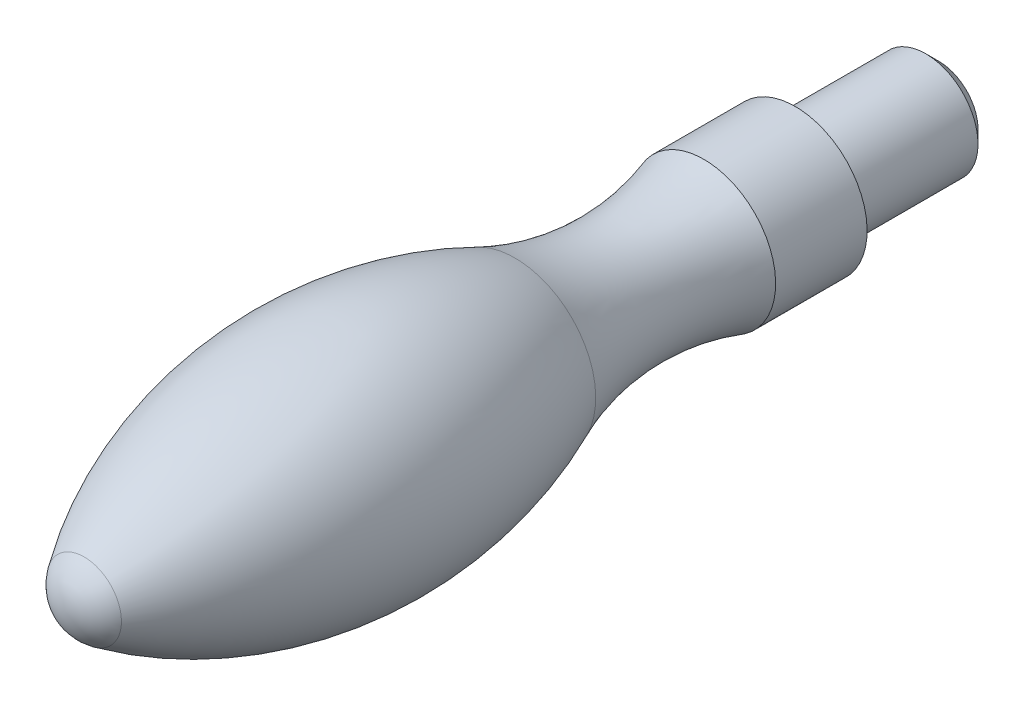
ISO-10303-21;
HEADER;
FILE_DESCRIPTION(('STEP AP214'),'2;1');
FILE_NAME('part.step','',(''),(''),'','','');
FILE_SCHEMA(('AUTOMOTIVE_DESIGN { 1 0 10303 214 1 1 1 1 }'));
ENDSEC;
DATA;
#1=APPLICATION_CONTEXT('core data for automotive mechanical design processes');
#2=APPLICATION_PROTOCOL_DEFINITION('international standard','automotive_design',2000,#1);
#3=PRODUCT_CONTEXT('',#1,'mechanical');
#4=PRODUCT('Part','Part','',(#3));
#5=PRODUCT_RELATED_PRODUCT_CATEGORY('part','',(#4));
#6=PRODUCT_DEFINITION_FORMATION('','',#4);
#7=PRODUCT_DEFINITION_CONTEXT('part definition',#1,'design');
#8=PRODUCT_DEFINITION('design','',#6,#7);
#9=PRODUCT_DEFINITION_SHAPE('','',#8);
#10=(LENGTH_UNIT() NAMED_UNIT(*) SI_UNIT(.MILLI.,.METRE.));
#11=(NAMED_UNIT(*) PLANE_ANGLE_UNIT() SI_UNIT($,.RADIAN.));
#12=(NAMED_UNIT(*) SI_UNIT($,.STERADIAN.) SOLID_ANGLE_UNIT());
#13=UNCERTAINTY_MEASURE_WITH_UNIT(LENGTH_MEASURE(1.E-05),#10,'distance_accuracy_value','');
#14=(GEOMETRIC_REPRESENTATION_CONTEXT(3) GLOBAL_UNCERTAINTY_ASSIGNED_CONTEXT((#13)) GLOBAL_UNIT_ASSIGNED_CONTEXT((#10,
#11,#12)) REPRESENTATION_CONTEXT('',''));
#15=CARTESIAN_POINT('',(0.,0.,0.));
#16=DIRECTION('',(0.,0.,1.));
#17=DIRECTION('',(1.,0.,0.));
#18=AXIS2_PLACEMENT_3D('',#15,#16,#17);
#19=CARTESIAN_POINT('',(0.,-1.94289029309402E-13,-26.9593603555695));
#20=DIRECTION('',(0.,0.,-1.));
#21=DIRECTION('',(0.,-1.,0.));
#22=AXIS2_PLACEMENT_3D('',#19,#20,#21);
#23=CYLINDRICAL_SURFACE('',#22,8.);
#24=CARTESIAN_POINT('',(0.,-1.92223031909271E-13,-20.));
#25=DIRECTION('',(0.,0.,-1.));
#26=DIRECTION('',(0.,1.,0.));
#27=AXIS2_PLACEMENT_3D('',#24,#25,#26);
#28=CIRCLE('',#27,8.);
#29=CARTESIAN_POINT('',(0.,7.99999999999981,-20.));
#30=VERTEX_POINT('',#29);
#31=EDGE_CURVE('E8',#30,#30,#28,.F.);
#32=ORIENTED_EDGE('',*,*,#31,.T.);
#33=EDGE_LOOP('',(#32));
#34=FACE_BOUND('',#33,.T.);
#35=CARTESIAN_POINT('',(0.,0.,0.));
#36=DIRECTION('',(0.,0.,-1.));
#37=DIRECTION('',(0.,-1.,0.));
#38=AXIS2_PLACEMENT_3D('',#35,#36,#37);
#39=CIRCLE('',#38,8.);
#40=CARTESIAN_POINT('',(0.,-8.,0.));
#41=VERTEX_POINT('',#40);
#42=EDGE_CURVE('E38',#41,#41,#39,.T.);
#43=ORIENTED_EDGE('',*,*,#42,.T.);
#44=EDGE_LOOP('',(#43));
#45=FACE_BOUND('',#44,.T.);
#46=ADVANCED_FACE('F12',(#34,#45),#23,.T.);
#47=CARTESIAN_POINT('',(0.,-2.22044604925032E-13,-22.));
#48=DIRECTION('',(0.,0.,-1.));
#49=DIRECTION('',(0.,-1.,0.));
#50=AXIS2_PLACEMENT_3D('',#47,#48,#49);
#51=PLANE('',#50);
#52=CARTESIAN_POINT('',(0.,-1.92816763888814E-13,-22.));
#53=DIRECTION('',(0.,0.,-1.));
#54=DIRECTION('',(0.,1.,0.));
#55=AXIS2_PLACEMENT_3D('',#52,#53,#54);
#56=CIRCLE('',#55,6.);
#57=CARTESIAN_POINT('',(0.,5.99999999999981,-22.));
#58=VERTEX_POINT('',#57);
#59=EDGE_CURVE('E19',#58,#58,#56,.T.);
#60=ORIENTED_EDGE('',*,*,#59,.T.);
#61=EDGE_LOOP('',(#60));
#62=FACE_BOUND('',#61,.T.);
#63=ADVANCED_FACE('F59',(#62),#51,.T.);
#64=CARTESIAN_POINT('',(0.,0.,105.021841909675));
#65=DIRECTION('',(-1.,0.,0.));
#66=DIRECTION('',(0.,3.23786493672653E-06,0.999999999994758));
#67=AXIS2_PLACEMENT_3D('',#64,#65,#66);
#68=SPHERICAL_SURFACE('',#67,6.97815809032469);
#69=CARTESIAN_POINT('',(0.,0.,105.021841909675));
#70=DIRECTION('',(0.,0.,-1.));
#71=DIRECTION('',(0.,-1.,0.));
#72=AXIS2_PLACEMENT_3D('',#69,#70,#71);
#73=SPHERICAL_SURFACE('',#72,6.97815809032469);
#74=CARTESIAN_POINT('',(0.,0.,109.022088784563));
#75=DIRECTION('',(0.,0.,-1.));
#76=DIRECTION('',(0.,-1.,0.));
#77=AXIS2_PLACEMENT_3D('',#74,#75,#76);
#78=CIRCLE('',#77,5.71775439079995);
#79=CARTESIAN_POINT('',(0.,-5.71775439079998,109.022088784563));
#80=VERTEX_POINT('',#79);
#81=EDGE_CURVE('E23',#80,#80,#78,.T.);
#82=ORIENTED_EDGE('',*,*,#81,.F.);
#83=EDGE_LOOP('',(#82));
#84=FACE_BOUND('',#83,.T.);
#85=ADVANCED_FACE('F64',(#84),#73,.T.);
#86=CARTESIAN_POINT('',(0.,-1.38777878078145E-13,70.0409158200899));
#87=DIRECTION('',(0.,0.,-1.));
#88=DIRECTION('',(0.,-1.,0.));
#89=AXIS2_PLACEMENT_3D('',#86,#87,#88);
#90=DEGENERATE_TOROIDAL_SURFACE('',#89,49.9999999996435,68.,.F.);
#91=CARTESIAN_POINT('',(0.,0.,42.9841509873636));
#92=DIRECTION('',(0.,0.,-1.));
#93=DIRECTION('',(0.,-1.,0.));
#94=AXIS2_PLACEMENT_3D('',#91,#92,#93);
#95=CIRCLE('',#94,12.3853466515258);
#96=CARTESIAN_POINT('',(0.,-12.3853466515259,42.9841509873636));
#97=VERTEX_POINT('',#96);
#98=EDGE_CURVE('E27',#97,#97,#95,.T.);
#99=ORIENTED_EDGE('',*,*,#98,.F.);
#100=EDGE_LOOP('',(#99));
#101=FACE_BOUND('',#100,.T.);
#102=ORIENTED_EDGE('',*,*,#81,.T.);
#103=EDGE_LOOP('',(#102));
#104=FACE_BOUND('',#103,.T.);
#105=ADVANCED_FACE('F69',(#101,#104),#90,.F.);
#106=CARTESIAN_POINT('',(0.,0.,26.6705133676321));
#107=DIRECTION('',(0.,0.,-1.));
#108=DIRECTION('',(0.,-1.,0.));
#109=AXIS2_PLACEMENT_3D('',#106,#107,#108);
#110=TOROIDAL_SURFACE('',#109,50.0000409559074,41.);
#111=ORIENTED_EDGE('',*,*,#98,.T.);
#112=EDGE_LOOP('',(#111));
#113=FACE_BOUND('',#112,.T.);
#114=CARTESIAN_POINT('',(0.,-1.11022302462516E-13,14.0215290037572));
#115=DIRECTION('',(0.,0.,-1.));
#116=DIRECTION('',(0.,-1.,0.));
#117=AXIS2_PLACEMENT_3D('',#114,#115,#116);
#118=CIRCLE('',#117,11.);
#119=CARTESIAN_POINT('',(0.,-11.0000000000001,14.0215290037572));
#120=VERTEX_POINT('',#119);
#121=EDGE_CURVE('E32',#120,#120,#118,.T.);
#122=ORIENTED_EDGE('',*,*,#121,.F.);
#123=EDGE_LOOP('',(#122));
#124=FACE_BOUND('',#123,.T.);
#125=ADVANCED_FACE('F55',(#113,#124),#110,.F.);
#126=CARTESIAN_POINT('',(0.,-1.94289029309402E-13,-26.9593603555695));
#127=DIRECTION('',(0.,0.,-1.));
#128=DIRECTION('',(0.,-1.,0.));
#129=AXIS2_PLACEMENT_3D('',#126,#127,#128);
#130=CYLINDRICAL_SURFACE('',#129,11.);
#131=CARTESIAN_POINT('',(0.,0.,0.));
#132=DIRECTION('',(0.,0.,-1.));
#133=DIRECTION('',(0.,-1.,0.));
#134=AXIS2_PLACEMENT_3D('',#131,#132,#133);
#135=CIRCLE('',#134,11.);
#136=CARTESIAN_POINT('',(0.,-11.,0.));
#137=VERTEX_POINT('',#136);
#138=EDGE_CURVE('E35',#137,#137,#135,.T.);
#139=ORIENTED_EDGE('',*,*,#138,.F.);
#140=EDGE_LOOP('',(#139));
#141=FACE_BOUND('',#140,.T.);
#142=ORIENTED_EDGE('',*,*,#121,.T.);
#143=EDGE_LOOP('',(#142));
#144=FACE_BOUND('',#143,.T.);
#145=ADVANCED_FACE('F45',(#141,#144),#130,.T.);
#146=CARTESIAN_POINT('',(0.,8.,0.));
#147=DIRECTION('',(0.,0.,-1.));
#148=DIRECTION('',(0.,-1.,0.));
#149=AXIS2_PLACEMENT_3D('',#146,#147,#148);
#150=PLANE('',#149);
#151=ORIENTED_EDGE('',*,*,#138,.T.);
#152=EDGE_LOOP('',(#151));
#153=FACE_BOUND('',#152,.T.);
#154=ORIENTED_EDGE('',*,*,#42,.F.);
#155=EDGE_LOOP('',(#154));
#156=FACE_BOUND('',#155,.T.);
#157=ADVANCED_FACE('F43',(#153,#156),#150,.T.);
#158=CARTESIAN_POINT('',(0.,-1.92816763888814E-13,-22.));
#159=DIRECTION('',(0.,0.,1.));
#160=DIRECTION('',(0.,-1.,0.));
#161=AXIS2_PLACEMENT_3D('',#158,#159,#160);
#162=CONICAL_SURFACE('',#161,6.,0.785398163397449);
#163=ORIENTED_EDGE('',*,*,#31,.F.);
#164=EDGE_LOOP('',(#163));
#165=FACE_BOUND('',#164,.T.);
#166=ORIENTED_EDGE('',*,*,#59,.F.);
#167=EDGE_LOOP('',(#166));
#168=FACE_BOUND('',#167,.T.);
#169=ADVANCED_FACE('F14',(#165,#168),#162,.T.);
#170=CLOSED_SHELL('',(#46,#63,#85,#105,#125,#145,#157,#169));
#171=MANIFOLD_SOLID_BREP('B1',#170);
#172=ADVANCED_BREP_SHAPE_REPRESENTATION('',(#18,#171),#14);
#173=SHAPE_DEFINITION_REPRESENTATION(#9,#172);
ENDSEC;
END-ISO-10303-21;
